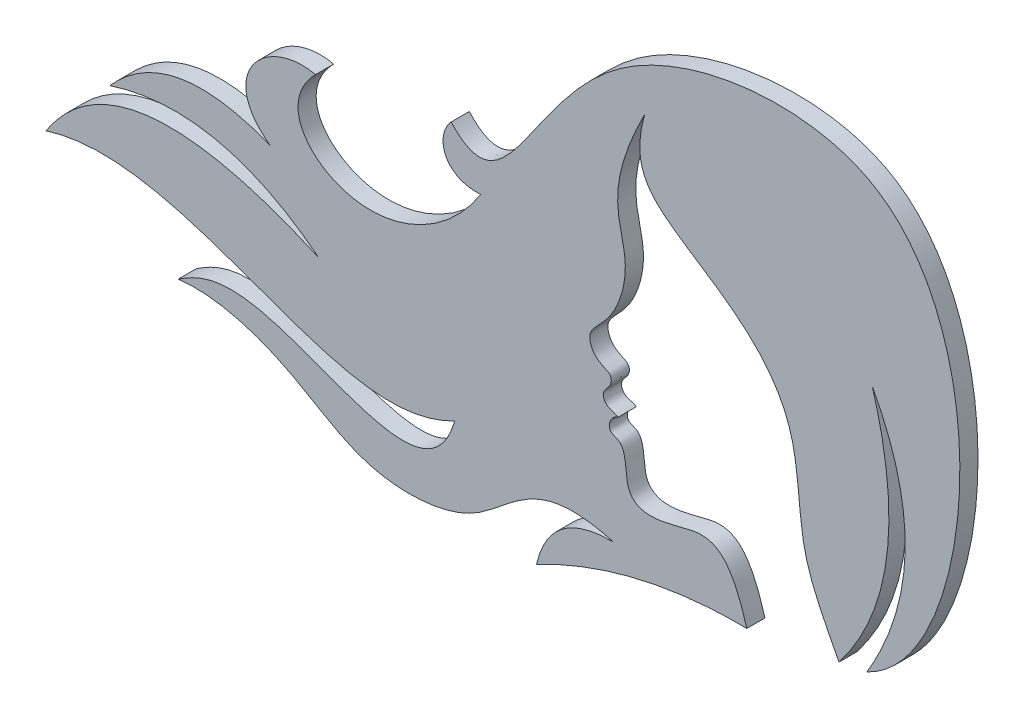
ISO-10303-21;
HEADER;
FILE_DESCRIPTION(('STEP AP214'),'2;1');
FILE_NAME('part.step','',(''),(''),'','','');
FILE_SCHEMA(('AUTOMOTIVE_DESIGN { 1 0 10303 214 1 1 1 1 }'));
ENDSEC;
DATA;
#1=APPLICATION_CONTEXT('core data for automotive mechanical design processes');
#2=APPLICATION_PROTOCOL_DEFINITION('international standard','automotive_design',2000,#1);
#3=PRODUCT_CONTEXT('',#1,'mechanical');
#4=PRODUCT('Part','Part','',(#3));
#5=PRODUCT_RELATED_PRODUCT_CATEGORY('part','',(#4));
#6=PRODUCT_DEFINITION_FORMATION('','',#4);
#7=PRODUCT_DEFINITION_CONTEXT('part definition',#1,'design');
#8=PRODUCT_DEFINITION('design','',#6,#7);
#9=PRODUCT_DEFINITION_SHAPE('','',#8);
#10=(LENGTH_UNIT() NAMED_UNIT(*) SI_UNIT(.MILLI.,.METRE.));
#11=(NAMED_UNIT(*) PLANE_ANGLE_UNIT() SI_UNIT($,.RADIAN.));
#12=(NAMED_UNIT(*) SI_UNIT($,.STERADIAN.) SOLID_ANGLE_UNIT());
#13=UNCERTAINTY_MEASURE_WITH_UNIT(LENGTH_MEASURE(1.E-05),#10,'distance_accuracy_value','');
#14=(GEOMETRIC_REPRESENTATION_CONTEXT(3) GLOBAL_UNCERTAINTY_ASSIGNED_CONTEXT((#13)) GLOBAL_UNIT_ASSIGNED_CONTEXT((#10,
#11,#12)) REPRESENTATION_CONTEXT('',''));
#15=CARTESIAN_POINT('',(0.,0.,0.));
#16=DIRECTION('',(0.,0.,1.));
#17=DIRECTION('',(1.,0.,0.));
#18=AXIS2_PLACEMENT_3D('',#15,#16,#17);
#19=CARTESIAN_POINT('',(99.8352403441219,60.9263576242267,10.));
#20=CARTESIAN_POINT('',(137.590325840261,-8.76878707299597,10.));
#21=CARTESIAN_POINT('',(96.8815916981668,-76.9582666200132,10.));
#22=B_SPLINE_CURVE_WITH_KNOTS('',2,(#19,#20,#21),.UNSPECIFIED.,.F.,.F.,(3,3),(0.,1.),.UNSPECIFIED.);
#23=DIRECTION('',(0.,0.,-1.));
#24=VECTOR('',#23,1.);
#25=SURFACE_OF_LINEAR_EXTRUSION('',#22,#24);
#26=CARTESIAN_POINT('',(99.8352403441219,60.9263576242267,0.));
#27=CARTESIAN_POINT('',(137.590325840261,-8.76878707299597,0.));
#28=CARTESIAN_POINT('',(96.8815916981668,-76.9582666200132,0.));
#29=B_SPLINE_CURVE_WITH_KNOTS('',2,(#26,#27,#28),.UNSPECIFIED.,.F.,.F.,(3,3),(0.,1.),.UNSPECIFIED.);
#30=CARTESIAN_POINT('',(99.8352403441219,60.9263576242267,0.));
#31=VERTEX_POINT('',#30);
#32=CARTESIAN_POINT('',(96.8815916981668,-76.9582666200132,0.));
#33=VERTEX_POINT('',#32);
#34=EDGE_CURVE('E408',#31,#33,#29,.T.);
#35=ORIENTED_EDGE('',*,*,#34,.T.);
#36=DIRECTION('',(0.,0.,-1.));
#37=VECTOR('',#36,1.);
#38=CARTESIAN_POINT('',(96.8815916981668,-76.9582666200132,10.));
#39=LINE('',#38,#37);
#40=CARTESIAN_POINT('',(96.8815916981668,-76.9582666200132,10.));
#41=VERTEX_POINT('',#40);
#42=EDGE_CURVE('E11',#41,#33,#39,.T.);
#43=ORIENTED_EDGE('',*,*,#42,.F.);
#44=CARTESIAN_POINT('',(99.8352403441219,60.9263576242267,10.));
#45=VERTEX_POINT('',#44);
#46=EDGE_CURVE('E335',#45,#41,#22,.T.);
#47=ORIENTED_EDGE('',*,*,#46,.F.);
#48=DIRECTION('',(0.,0.,-1.));
#49=VECTOR('',#48,1.);
#50=CARTESIAN_POINT('',(99.8352403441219,60.9263576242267,10.));
#51=LINE('',#50,#49);
#52=EDGE_CURVE('E179',#45,#31,#51,.T.);
#53=ORIENTED_EDGE('',*,*,#52,.T.);
#54=EDGE_LOOP('',(#35,#43,#47,#53));
#55=FACE_BOUND('',#54,.T.);
#56=ADVANCED_FACE('F32',(#55),#25,.F.);
#57=CARTESIAN_POINT('',(96.8815916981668,-76.9582666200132,10.));
#58=CARTESIAN_POINT('',(151.249906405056,-51.4561359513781,10.));
#59=CARTESIAN_POINT('',(169.949297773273,100.000549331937,10.));
#60=CARTESIAN_POINT('',(76.3462922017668,179.474560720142,10.));
#61=CARTESIAN_POINT('',(-80.7115780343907,161.453070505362,10.));
#62=CARTESIAN_POINT('',(-100.716469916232,37.1369566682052,10.));
#63=CARTESIAN_POINT('',(-132.148595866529,70.8984549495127,10.));
#64=B_SPLINE_CURVE_WITH_KNOTS('',3,(#57,#58,#59,#60,#61,#62,#63),.UNSPECIFIED.,.F.,.F.,(4,1,1,1,
4),(0.,0.421721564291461,0.47224751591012,0.700633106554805,1.),.UNSPECIFIED.);
#65=DIRECTION('',(0.,0.,-1.));
#66=VECTOR('',#65,1.);
#67=SURFACE_OF_LINEAR_EXTRUSION('',#64,#66);
#68=CARTESIAN_POINT('',(96.8815916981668,-76.9582666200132,0.));
#69=CARTESIAN_POINT('',(151.249906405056,-51.4561359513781,0.));
#70=CARTESIAN_POINT('',(169.949297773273,100.000549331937,0.));
#71=CARTESIAN_POINT('',(76.3462922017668,179.474560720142,0.));
#72=CARTESIAN_POINT('',(-80.7115780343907,161.453070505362,0.));
#73=CARTESIAN_POINT('',(-100.716469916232,37.1369566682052,0.));
#74=CARTESIAN_POINT('',(-132.148595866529,70.8984549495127,0.));
#75=B_SPLINE_CURVE_WITH_KNOTS('',3,(#68,#69,#70,#71,#72,#73,#74),.UNSPECIFIED.,.F.,.F.,(4,1,1,1,
4),(0.,0.421721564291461,0.47224751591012,0.700633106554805,1.),.UNSPECIFIED.);
#76=CARTESIAN_POINT('',(-132.148595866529,70.8984549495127,0.));
#77=VERTEX_POINT('',#76);
#78=EDGE_CURVE('E402',#33,#77,#75,.T.);
#79=ORIENTED_EDGE('',*,*,#78,.T.);
#80=DIRECTION('',(0.,0.,-1.));
#81=VECTOR('',#80,1.);
#82=CARTESIAN_POINT('',(-132.148595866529,70.8984549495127,10.));
#83=LINE('',#82,#81);
#84=CARTESIAN_POINT('',(-132.148595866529,70.8984549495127,10.));
#85=VERTEX_POINT('',#84);
#86=EDGE_CURVE('E41',#85,#77,#83,.T.);
#87=ORIENTED_EDGE('',*,*,#86,.F.);
#88=EDGE_CURVE('E119',#41,#85,#64,.T.);
#89=ORIENTED_EDGE('',*,*,#88,.F.);
#90=ORIENTED_EDGE('',*,*,#42,.T.);
#91=EDGE_LOOP('',(#79,#87,#89,#90));
#92=FACE_BOUND('',#91,.T.);
#93=ADVANCED_FACE('F329',(#92),#67,.F.);
#94=CARTESIAN_POINT('',(-132.148595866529,70.8984549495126,10.));
#95=CARTESIAN_POINT('',(-141.700592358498,60.3257250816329,10.));
#96=CARTESIAN_POINT('',(-135.75112447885,42.9581999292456,10.));
#97=CARTESIAN_POINT('',(-115.791263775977,44.5518507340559,10.));
#98=B_SPLINE_CURVE_WITH_KNOTS('',3,(#94,#95,#96,#97),.UNSPECIFIED.,.F.,.F.,(4,4),(0.,1.),.UNSPECIFIED.);
#99=DIRECTION('',(0.,0.,-1.));
#100=VECTOR('',#99,1.);
#101=SURFACE_OF_LINEAR_EXTRUSION('',#98,#100);
#102=CARTESIAN_POINT('',(-132.148595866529,70.8984549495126,0.));
#103=CARTESIAN_POINT('',(-141.700592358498,60.3257250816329,0.));
#104=CARTESIAN_POINT('',(-135.75112447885,42.9581999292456,0.));
#105=CARTESIAN_POINT('',(-115.791263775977,44.5518507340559,0.));
#106=B_SPLINE_CURVE_WITH_KNOTS('',3,(#102,#103,#104,#105),.UNSPECIFIED.,.F.,.F.,(4,4),(0.,1.),.UNSPECIFIED.);
#107=CARTESIAN_POINT('',(-115.791263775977,44.5518507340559,0.));
#108=VERTEX_POINT('',#107);
#109=EDGE_CURVE('E397',#77,#108,#106,.T.);
#110=ORIENTED_EDGE('',*,*,#109,.T.);
#111=DIRECTION('',(0.,0.,-1.));
#112=VECTOR('',#111,1.);
#113=CARTESIAN_POINT('',(-115.791263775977,44.5518507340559,10.));
#114=LINE('',#113,#112);
#115=CARTESIAN_POINT('',(-115.791263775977,44.5518507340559,10.));
#116=VERTEX_POINT('',#115);
#117=EDGE_CURVE('E391',#116,#108,#114,.T.);
#118=ORIENTED_EDGE('',*,*,#117,.F.);
#119=EDGE_CURVE('E315',#85,#116,#98,.T.);
#120=ORIENTED_EDGE('',*,*,#119,.F.);
#121=ORIENTED_EDGE('',*,*,#86,.T.);
#122=EDGE_LOOP('',(#110,#118,#120,#121));
#123=FACE_BOUND('',#122,.T.);
#124=ADVANCED_FACE('F326',(#123),#101,.F.);
#125=CARTESIAN_POINT('',(-115.791263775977,44.5518507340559,10.));
#126=CARTESIAN_POINT('',(-135.439486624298,13.6685695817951,10.));
#127=CARTESIAN_POINT('',(-193.356166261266,-8.74086985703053,10.));
#128=CARTESIAN_POINT('',(-227.746354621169,34.902635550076,10.));
#129=CARTESIAN_POINT('',(-206.820135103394,56.1612771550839,10.));
#130=B_SPLINE_CURVE_WITH_KNOTS('',3,(#125,#126,#127,#128,#129),.UNSPECIFIED.,.F.,.F.,(4,1,4),
(0.,0.521453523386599,1.),.UNSPECIFIED.);
#131=DIRECTION('',(0.,0.,-1.));
#132=VECTOR('',#131,1.);
#133=SURFACE_OF_LINEAR_EXTRUSION('',#130,#132);
#134=CARTESIAN_POINT('',(-115.791263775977,44.5518507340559,0.));
#135=CARTESIAN_POINT('',(-135.439486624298,13.6685695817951,0.));
#136=CARTESIAN_POINT('',(-193.356166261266,-8.74086985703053,0.));
#137=CARTESIAN_POINT('',(-227.746354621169,34.902635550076,0.));
#138=CARTESIAN_POINT('',(-206.820135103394,56.1612771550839,0.));
#139=B_SPLINE_CURVE_WITH_KNOTS('',3,(#134,#135,#136,#137,#138),.UNSPECIFIED.,.F.,.F.,(4,1,4),
(0.,0.521453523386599,1.),.UNSPECIFIED.);
#140=CARTESIAN_POINT('',(-206.820135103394,56.1612771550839,0.));
#141=VERTEX_POINT('',#140);
#142=EDGE_CURVE('E404',#108,#141,#139,.T.);
#143=ORIENTED_EDGE('',*,*,#142,.T.);
#144=DIRECTION('',(0.,0.,-1.));
#145=VECTOR('',#144,1.);
#146=CARTESIAN_POINT('',(-206.820135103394,56.1612771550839,10.));
#147=LINE('',#146,#145);
#148=CARTESIAN_POINT('',(-206.820135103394,56.1612771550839,10.));
#149=VERTEX_POINT('',#148);
#150=EDGE_CURVE('E388',#149,#141,#147,.T.);
#151=ORIENTED_EDGE('',*,*,#150,.F.);
#152=EDGE_CURVE('E307',#116,#149,#130,.T.);
#153=ORIENTED_EDGE('',*,*,#152,.F.);
#154=ORIENTED_EDGE('',*,*,#117,.T.);
#155=EDGE_LOOP('',(#143,#151,#153,#154));
#156=FACE_BOUND('',#155,.T.);
#157=ADVANCED_FACE('F323',(#156),#133,.F.);
#158=CARTESIAN_POINT('',(-206.820135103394,56.1612771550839,10.));
#159=CARTESIAN_POINT('',(-234.246412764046,62.3301629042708,10.));
#160=CARTESIAN_POINT('',(-262.813753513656,32.2946086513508,10.));
#161=CARTESIAN_POINT('',(-231.67156276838,9.8032229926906,10.));
#162=B_SPLINE_CURVE_WITH_KNOTS('',3,(#158,#159,#160,#161),.UNSPECIFIED.,.F.,.F.,(4,4),(0.,1.),.UNSPECIFIED.);
#163=DIRECTION('',(0.,0.,-1.));
#164=VECTOR('',#163,1.);
#165=SURFACE_OF_LINEAR_EXTRUSION('',#162,#164);
#166=CARTESIAN_POINT('',(-206.820135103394,56.1612771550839,0.));
#167=CARTESIAN_POINT('',(-234.246412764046,62.3301629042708,0.));
#168=CARTESIAN_POINT('',(-262.813753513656,32.2946086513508,0.));
#169=CARTESIAN_POINT('',(-231.67156276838,9.8032229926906,0.));
#170=B_SPLINE_CURVE_WITH_KNOTS('',3,(#166,#167,#168,#169),.UNSPECIFIED.,.F.,.F.,(4,4),(0.,1.),.UNSPECIFIED.);
#171=CARTESIAN_POINT('',(-231.67156276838,9.8032229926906,0.));
#172=VERTEX_POINT('',#171);
#173=EDGE_CURVE('E406',#141,#172,#170,.T.);
#174=ORIENTED_EDGE('',*,*,#173,.T.);
#175=DIRECTION('',(0.,0.,-1.));
#176=VECTOR('',#175,1.);
#177=CARTESIAN_POINT('',(-231.67156276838,9.8032229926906,10.));
#178=LINE('',#177,#176);
#179=CARTESIAN_POINT('',(-231.67156276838,9.8032229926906,10.));
#180=VERTEX_POINT('',#179);
#181=EDGE_CURVE('E385',#180,#172,#178,.T.);
#182=ORIENTED_EDGE('',*,*,#181,.F.);
#183=EDGE_CURVE('E299',#149,#180,#162,.T.);
#184=ORIENTED_EDGE('',*,*,#183,.F.);
#185=ORIENTED_EDGE('',*,*,#150,.T.);
#186=EDGE_LOOP('',(#174,#182,#184,#185));
#187=FACE_BOUND('',#186,.T.);
#188=ADVANCED_FACE('F291',(#187),#165,.F.);
#189=CARTESIAN_POINT('',(-231.67156276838,9.80322299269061,10.));
#190=CARTESIAN_POINT('',(-286.85305069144,31.9451961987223,10.));
#191=CARTESIAN_POINT('',(-320.13333992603,-5.71931170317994,10.));
#192=B_SPLINE_CURVE_WITH_KNOTS('',2,(#189,#190,#191),.UNSPECIFIED.,.F.,.F.,(3,3),(0.,1.),.UNSPECIFIED.);
#193=DIRECTION('',(0.,0.,-1.));
#194=VECTOR('',#193,1.);
#195=SURFACE_OF_LINEAR_EXTRUSION('',#192,#194);
#196=CARTESIAN_POINT('',(-231.67156276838,9.80322299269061,0.));
#197=CARTESIAN_POINT('',(-286.85305069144,31.9451961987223,0.));
#198=CARTESIAN_POINT('',(-320.13333992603,-5.71931170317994,0.));
#199=B_SPLINE_CURVE_WITH_KNOTS('',2,(#196,#197,#198),.UNSPECIFIED.,.F.,.F.,(3,3),(0.,1.),.UNSPECIFIED.);
#200=CARTESIAN_POINT('',(-320.13333992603,-5.71931170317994,0.));
#201=VERTEX_POINT('',#200);
#202=EDGE_CURVE('E426',#172,#201,#199,.T.);
#203=ORIENTED_EDGE('',*,*,#202,.T.);
#204=DIRECTION('',(0.,0.,-1.));
#205=VECTOR('',#204,1.);
#206=CARTESIAN_POINT('',(-320.13333992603,-5.71931170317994,10.));
#207=LINE('',#206,#205);
#208=CARTESIAN_POINT('',(-320.13333992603,-5.71931170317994,10.));
#209=VERTEX_POINT('',#208);
#210=EDGE_CURVE('E382',#209,#201,#207,.T.);
#211=ORIENTED_EDGE('',*,*,#210,.F.);
#212=EDGE_CURVE('E295',#180,#209,#192,.T.);
#213=ORIENTED_EDGE('',*,*,#212,.F.);
#214=ORIENTED_EDGE('',*,*,#181,.T.);
#215=EDGE_LOOP('',(#203,#211,#213,#214));
#216=FACE_BOUND('',#215,.T.);
#217=ADVANCED_FACE('F287',(#216),#195,.F.);
#218=CARTESIAN_POINT('',(-320.13333992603,-5.71931170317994,10.));
#219=CARTESIAN_POINT('',(-260.532142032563,13.531515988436,10.));
#220=CARTESIAN_POINT('',(-204.885519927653,-30.3887998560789,10.));
#221=B_SPLINE_CURVE_WITH_KNOTS('',2,(#218,#219,#220),.UNSPECIFIED.,.F.,.F.,(3,3),(0.,1.),.UNSPECIFIED.);
#222=DIRECTION('',(0.,0.,-1.));
#223=VECTOR('',#222,1.);
#224=SURFACE_OF_LINEAR_EXTRUSION('',#221,#223);
#225=CARTESIAN_POINT('',(-320.13333992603,-5.71931170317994,0.));
#226=CARTESIAN_POINT('',(-260.532142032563,13.531515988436,0.));
#227=CARTESIAN_POINT('',(-204.885519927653,-30.3887998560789,0.));
#228=B_SPLINE_CURVE_WITH_KNOTS('',2,(#225,#226,#227),.UNSPECIFIED.,.F.,.F.,(3,3),(0.,1.),.UNSPECIFIED.);
#229=CARTESIAN_POINT('',(-204.885519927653,-30.3887998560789,0.));
#230=VERTEX_POINT('',#229);
#231=EDGE_CURVE('E433',#201,#230,#228,.T.);
#232=ORIENTED_EDGE('',*,*,#231,.T.);
#233=DIRECTION('',(0.,0.,-1.));
#234=VECTOR('',#233,1.);
#235=CARTESIAN_POINT('',(-204.885519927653,-30.3887998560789,10.));
#236=LINE('',#235,#234);
#237=CARTESIAN_POINT('',(-204.885519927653,-30.3887998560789,10.));
#238=VERTEX_POINT('',#237);
#239=EDGE_CURVE('E379',#238,#230,#236,.T.);
#240=ORIENTED_EDGE('',*,*,#239,.F.);
#241=EDGE_CURVE('E272',#209,#238,#221,.T.);
#242=ORIENTED_EDGE('',*,*,#241,.F.);
#243=ORIENTED_EDGE('',*,*,#210,.T.);
#244=EDGE_LOOP('',(#232,#240,#242,#243));
#245=FACE_BOUND('',#244,.T.);
#246=ADVANCED_FACE('F283',(#245),#224,.F.);
#247=CARTESIAN_POINT('',(-204.885519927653,-30.3887998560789,10.));
#248=CARTESIAN_POINT('',(-314.211220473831,18.7262655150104,10.));
#249=CARTESIAN_POINT('',(-355.30953903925,-44.8919209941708,10.));
#250=B_SPLINE_CURVE_WITH_KNOTS('',2,(#247,#248,#249),.UNSPECIFIED.,.F.,.F.,(3,3),(0.,1.),.UNSPECIFIED.);
#251=DIRECTION('',(0.,0.,-1.));
#252=VECTOR('',#251,1.);
#253=SURFACE_OF_LINEAR_EXTRUSION('',#250,#252);
#254=CARTESIAN_POINT('',(-204.885519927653,-30.3887998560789,0.));
#255=CARTESIAN_POINT('',(-314.211220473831,18.7262655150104,0.));
#256=CARTESIAN_POINT('',(-355.30953903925,-44.8919209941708,0.));
#257=B_SPLINE_CURVE_WITH_KNOTS('',2,(#254,#255,#256),.UNSPECIFIED.,.F.,.F.,(3,3),(0.,1.),.UNSPECIFIED.);
#258=CARTESIAN_POINT('',(-355.30953903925,-44.8919209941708,0.));
#259=VERTEX_POINT('',#258);
#260=EDGE_CURVE('E440',#230,#259,#257,.T.);
#261=ORIENTED_EDGE('',*,*,#260,.T.);
#262=DIRECTION('',(0.,0.,-1.));
#263=VECTOR('',#262,1.);
#264=CARTESIAN_POINT('',(-355.30953903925,-44.8919209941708,10.));
#265=LINE('',#264,#263);
#266=CARTESIAN_POINT('',(-355.30953903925,-44.8919209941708,10.));
#267=VERTEX_POINT('',#266);
#268=EDGE_CURVE('E376',#267,#259,#265,.T.);
#269=ORIENTED_EDGE('',*,*,#268,.F.);
#270=EDGE_CURVE('E264',#238,#267,#250,.T.);
#271=ORIENTED_EDGE('',*,*,#270,.F.);
#272=ORIENTED_EDGE('',*,*,#239,.T.);
#273=EDGE_LOOP('',(#261,#269,#271,#272));
#274=FACE_BOUND('',#273,.T.);
#275=ADVANCED_FACE('F280',(#274),#253,.F.);
#276=CARTESIAN_POINT('',(-355.30953903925,-44.8919209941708,10.));
#277=CARTESIAN_POINT('',(-281.11164015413,-21.0648694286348,10.));
#278=CARTESIAN_POINT('',(-207.554873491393,-89.7677891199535,10.));
#279=CARTESIAN_POINT('',(-162.853756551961,-87.2780492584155,10.));
#280=CARTESIAN_POINT('',(-130.126908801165,-70.7790967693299,10.));
#281=B_SPLINE_CURVE_WITH_KNOTS('',4,(#276,#277,#278,#279,#280),.UNSPECIFIED.,.F.,.F.,(5,5),(0.,
1.),.UNSPECIFIED.);
#282=DIRECTION('',(0.,0.,-1.));
#283=VECTOR('',#282,1.);
#284=SURFACE_OF_LINEAR_EXTRUSION('',#281,#283);
#285=CARTESIAN_POINT('',(-355.30953903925,-44.8919209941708,0.));
#286=CARTESIAN_POINT('',(-281.11164015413,-21.0648694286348,0.));
#287=CARTESIAN_POINT('',(-207.554873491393,-89.7677891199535,0.));
#288=CARTESIAN_POINT('',(-162.853756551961,-87.2780492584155,0.));
#289=CARTESIAN_POINT('',(-130.126908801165,-70.7790967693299,0.));
#290=B_SPLINE_CURVE_WITH_KNOTS('',4,(#285,#286,#287,#288,#289),.UNSPECIFIED.,.F.,.F.,(5,5),(0.,
1.),.UNSPECIFIED.);
#291=CARTESIAN_POINT('',(-130.126908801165,-70.7790967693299,0.));
#292=VERTEX_POINT('',#291);
#293=EDGE_CURVE('E447',#259,#292,#290,.T.);
#294=ORIENTED_EDGE('',*,*,#293,.T.);
#295=DIRECTION('',(0.,0.,-1.));
#296=VECTOR('',#295,1.);
#297=CARTESIAN_POINT('',(-130.126908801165,-70.7790967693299,10.));
#298=LINE('',#297,#296);
#299=CARTESIAN_POINT('',(-130.126908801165,-70.7790967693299,10.));
#300=VERTEX_POINT('',#299);
#301=EDGE_CURVE('E373',#300,#292,#298,.T.);
#302=ORIENTED_EDGE('',*,*,#301,.F.);
#303=EDGE_CURVE('E256',#267,#300,#281,.T.);
#304=ORIENTED_EDGE('',*,*,#303,.F.);
#305=ORIENTED_EDGE('',*,*,#268,.T.);
#306=EDGE_LOOP('',(#294,#302,#304,#305));
#307=FACE_BOUND('',#306,.T.);
#308=ADVANCED_FACE('F248',(#307),#284,.F.);
#309=CARTESIAN_POINT('',(-130.126908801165,-70.7790967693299,10.));
#310=CARTESIAN_POINT('',(-149.062899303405,-135.871564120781,10.));
#311=CARTESIAN_POINT('',(-228.830759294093,-51.3697065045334,10.));
#312=CARTESIAN_POINT('',(-259.719272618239,-64.2389946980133,10.));
#313=CARTESIAN_POINT('',(-282.507718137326,-79.2554248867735,10.));
#314=B_SPLINE_CURVE_WITH_KNOTS('',4,(#309,#310,#311,#312,#313),.UNSPECIFIED.,.F.,.F.,(5,5),(0.,
1.),.UNSPECIFIED.);
#315=DIRECTION('',(0.,0.,-1.));
#316=VECTOR('',#315,1.);
#317=SURFACE_OF_LINEAR_EXTRUSION('',#314,#316);
#318=CARTESIAN_POINT('',(-130.126908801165,-70.7790967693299,0.));
#319=CARTESIAN_POINT('',(-149.062899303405,-135.871564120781,0.));
#320=CARTESIAN_POINT('',(-228.830759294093,-51.3697065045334,0.));
#321=CARTESIAN_POINT('',(-259.719272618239,-64.2389946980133,0.));
#322=CARTESIAN_POINT('',(-282.507718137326,-79.2554248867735,0.));
#323=B_SPLINE_CURVE_WITH_KNOTS('',4,(#318,#319,#320,#321,#322),.UNSPECIFIED.,.F.,.F.,(5,5),(0.,
1.),.UNSPECIFIED.);
#324=CARTESIAN_POINT('',(-282.507718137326,-79.2554248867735,0.));
#325=VERTEX_POINT('',#324);
#326=EDGE_CURVE('E454',#292,#325,#323,.T.);
#327=ORIENTED_EDGE('',*,*,#326,.T.);
#328=DIRECTION('',(0.,0.,-1.));
#329=VECTOR('',#328,1.);
#330=CARTESIAN_POINT('',(-282.507718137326,-79.2554248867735,10.));
#331=LINE('',#330,#329);
#332=CARTESIAN_POINT('',(-282.507718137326,-79.2554248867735,10.));
#333=VERTEX_POINT('',#332);
#334=EDGE_CURVE('E370',#333,#325,#331,.T.);
#335=ORIENTED_EDGE('',*,*,#334,.F.);
#336=EDGE_CURVE('E252',#300,#333,#314,.T.);
#337=ORIENTED_EDGE('',*,*,#336,.F.);
#338=ORIENTED_EDGE('',*,*,#301,.T.);
#339=EDGE_LOOP('',(#327,#335,#337,#338));
#340=FACE_BOUND('',#339,.T.);
#341=ADVANCED_FACE('F244',(#340),#317,.F.);
#342=CARTESIAN_POINT('',(-282.507718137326,-79.2554248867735,10.));
#343=CARTESIAN_POINT('',(-269.859036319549,-77.56804431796,10.));
#344=CARTESIAN_POINT('',(-220.246837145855,-85.7671579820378,10.));
#345=CARTESIAN_POINT('',(-188.940245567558,-121.497280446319,10.));
#346=CARTESIAN_POINT('',(-104.940933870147,-116.747440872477,10.));
#347=CARTESIAN_POINT('',(-89.0037621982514,-71.6678324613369,10.));
#348=CARTESIAN_POINT('',(-42.6454999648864,-84.7637430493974,10.));
#349=B_SPLINE_CURVE_WITH_KNOTS('',3,(#342,#343,#344,#345,#346,#347,#348),.UNSPECIFIED.,.F.,.F.,
(4,1,1,1,4),(0.,0.11272234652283,0.428829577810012,0.649909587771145,1.),.UNSPECIFIED.);
#350=DIRECTION('',(0.,0.,-1.));
#351=VECTOR('',#350,1.);
#352=SURFACE_OF_LINEAR_EXTRUSION('',#349,#351);
#353=CARTESIAN_POINT('',(-282.507718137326,-79.2554248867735,0.));
#354=CARTESIAN_POINT('',(-269.859036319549,-77.56804431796,0.));
#355=CARTESIAN_POINT('',(-220.246837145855,-85.7671579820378,0.));
#356=CARTESIAN_POINT('',(-188.940245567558,-121.497280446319,0.));
#357=CARTESIAN_POINT('',(-104.940933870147,-116.747440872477,0.));
#358=CARTESIAN_POINT('',(-89.0037621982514,-71.6678324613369,0.));
#359=CARTESIAN_POINT('',(-42.6454999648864,-84.7637430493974,0.));
#360=B_SPLINE_CURVE_WITH_KNOTS('',3,(#353,#354,#355,#356,#357,#358,#359),.UNSPECIFIED.,.F.,.F.,
(4,1,1,1,4),(0.,0.11272234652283,0.428829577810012,0.649909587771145,1.),.UNSPECIFIED.);
#361=CARTESIAN_POINT('',(-42.6454999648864,-84.7637430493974,0.));
#362=VERTEX_POINT('',#361);
#363=EDGE_CURVE('E461',#325,#362,#360,.T.);
#364=ORIENTED_EDGE('',*,*,#363,.T.);
#365=DIRECTION('',(0.,0.,-1.));
#366=VECTOR('',#365,1.);
#367=CARTESIAN_POINT('',(-42.6454999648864,-84.7637430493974,10.));
#368=LINE('',#367,#366);
#369=CARTESIAN_POINT('',(-42.6454999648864,-84.7637430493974,10.));
#370=VERTEX_POINT('',#369);
#371=EDGE_CURVE('E367',#370,#362,#368,.T.);
#372=ORIENTED_EDGE('',*,*,#371,.F.);
#373=EDGE_CURVE('E229',#333,#370,#349,.T.);
#374=ORIENTED_EDGE('',*,*,#373,.F.);
#375=ORIENTED_EDGE('',*,*,#334,.T.);
#376=EDGE_LOOP('',(#364,#372,#374,#375));
#377=FACE_BOUND('',#376,.T.);
#378=ADVANCED_FACE('F240',(#377),#352,.F.);
#379=CARTESIAN_POINT('',(-42.6454999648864,-84.7637430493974,10.));
#380=CARTESIAN_POINT('',(-77.6160107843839,-84.5108672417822,10.));
#381=CARTESIAN_POINT('',(-85.073832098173,-116.568907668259,10.));
#382=B_SPLINE_CURVE_WITH_KNOTS('',2,(#379,#380,#381),.UNSPECIFIED.,.F.,.F.,(3,3),(0.,1.),.UNSPECIFIED.);
#383=DIRECTION('',(0.,0.,-1.));
#384=VECTOR('',#383,1.);
#385=SURFACE_OF_LINEAR_EXTRUSION('',#382,#384);
#386=CARTESIAN_POINT('',(-42.6454999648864,-84.7637430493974,0.));
#387=CARTESIAN_POINT('',(-77.6160107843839,-84.5108672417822,0.));
#388=CARTESIAN_POINT('',(-85.073832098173,-116.568907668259,0.));
#389=B_SPLINE_CURVE_WITH_KNOTS('',2,(#386,#387,#388),.UNSPECIFIED.,.F.,.F.,(3,3),(0.,1.),.UNSPECIFIED.);
#390=CARTESIAN_POINT('',(-85.073832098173,-116.568907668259,0.));
#391=VERTEX_POINT('',#390);
#392=EDGE_CURVE('E468',#362,#391,#389,.T.);
#393=ORIENTED_EDGE('',*,*,#392,.T.);
#394=DIRECTION('',(0.,0.,-1.));
#395=VECTOR('',#394,1.);
#396=CARTESIAN_POINT('',(-85.073832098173,-116.568907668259,10.));
#397=LINE('',#396,#395);
#398=CARTESIAN_POINT('',(-85.073832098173,-116.568907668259,10.));
#399=VERTEX_POINT('',#398);
#400=EDGE_CURVE('E364',#399,#391,#397,.T.);
#401=ORIENTED_EDGE('',*,*,#400,.F.);
#402=EDGE_CURVE('E221',#370,#399,#382,.T.);
#403=ORIENTED_EDGE('',*,*,#402,.F.);
#404=ORIENTED_EDGE('',*,*,#371,.T.);
#405=EDGE_LOOP('',(#393,#401,#403,#404));
#406=FACE_BOUND('',#405,.T.);
#407=ADVANCED_FACE('F237',(#406),#385,.F.);
#408=CARTESIAN_POINT('',(-85.073832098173,-116.568907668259,10.));
#409=CARTESIAN_POINT('',(-31.0566543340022,-88.3468480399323,10.));
#410=CARTESIAN_POINT('',(30.7603724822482,-89.2685976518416,10.));
#411=B_SPLINE_CURVE_WITH_KNOTS('',2,(#408,#409,#410),.UNSPECIFIED.,.F.,.F.,(3,3),(0.,1.),.UNSPECIFIED.);
#412=DIRECTION('',(0.,0.,-1.));
#413=VECTOR('',#412,1.);
#414=SURFACE_OF_LINEAR_EXTRUSION('',#411,#413);
#415=CARTESIAN_POINT('',(-85.073832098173,-116.568907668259,0.));
#416=CARTESIAN_POINT('',(-31.0566543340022,-88.3468480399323,0.));
#417=CARTESIAN_POINT('',(30.7603724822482,-89.2685976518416,0.));
#418=B_SPLINE_CURVE_WITH_KNOTS('',2,(#415,#416,#417),.UNSPECIFIED.,.F.,.F.,(3,3),(0.,1.),.UNSPECIFIED.);
#419=CARTESIAN_POINT('',(30.7603724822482,-89.2685976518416,0.));
#420=VERTEX_POINT('',#419);
#421=EDGE_CURVE('E475',#391,#420,#418,.T.);
#422=ORIENTED_EDGE('',*,*,#421,.T.);
#423=DIRECTION('',(0.,0.,-1.));
#424=VECTOR('',#423,1.);
#425=CARTESIAN_POINT('',(30.7603724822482,-89.2685976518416,10.));
#426=LINE('',#425,#424);
#427=CARTESIAN_POINT('',(30.7603724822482,-89.2685976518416,10.));
#428=VERTEX_POINT('',#427);
#429=EDGE_CURVE('E361',#428,#420,#426,.T.);
#430=ORIENTED_EDGE('',*,*,#429,.F.);
#431=EDGE_CURVE('E213',#399,#428,#411,.T.);
#432=ORIENTED_EDGE('',*,*,#431,.F.);
#433=ORIENTED_EDGE('',*,*,#400,.T.);
#434=EDGE_LOOP('',(#422,#430,#432,#433));
#435=FACE_BOUND('',#434,.T.);
#436=ADVANCED_FACE('F206',(#435),#414,.F.);
#437=CARTESIAN_POINT('',(30.7603724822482,-89.2685976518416,10.));
#438=CARTESIAN_POINT('',(19.4296879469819,-49.6692660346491,10.));
#439=CARTESIAN_POINT('',(-1.98620908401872,-60.3796240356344,10.));
#440=CARTESIAN_POINT('',(-38.406899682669,-65.1344416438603,10.));
#441=CARTESIAN_POINT('',(-34.8514093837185,-34.6017335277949,10.));
#442=CARTESIAN_POINT('',(-46.9784903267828,-33.3839305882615,10.));
#443=CARTESIAN_POINT('',(-44.0761329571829,-25.0411766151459,10.));
#444=CARTESIAN_POINT('',(-40.0406940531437,-23.8378800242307,10.));
#445=B_SPLINE_CURVE_WITH_KNOTS('',3,(#437,#438,#439,#440,#441,#442,#443,#444),.UNSPECIFIED.,.F.,
.F.,(4,1,1,1,1,4),(0.,0.437887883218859,0.723491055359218,0.877076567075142,0.931754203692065,
1.),.UNSPECIFIED.);
#446=DIRECTION('',(0.,0.,-1.));
#447=VECTOR('',#446,1.);
#448=SURFACE_OF_LINEAR_EXTRUSION('',#445,#447);
#449=CARTESIAN_POINT('',(30.7603724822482,-89.2685976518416,0.));
#450=CARTESIAN_POINT('',(19.4296879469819,-49.6692660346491,0.));
#451=CARTESIAN_POINT('',(-1.98620908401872,-60.3796240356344,0.));
#452=CARTESIAN_POINT('',(-38.406899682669,-65.1344416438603,0.));
#453=CARTESIAN_POINT('',(-34.8514093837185,-34.6017335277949,0.));
#454=CARTESIAN_POINT('',(-46.9784903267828,-33.3839305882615,0.));
#455=CARTESIAN_POINT('',(-44.0761329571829,-25.0411766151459,0.));
#456=CARTESIAN_POINT('',(-40.0406940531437,-23.8378800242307,0.));
#457=B_SPLINE_CURVE_WITH_KNOTS('',3,(#449,#450,#451,#452,#453,#454,#455,#456),.UNSPECIFIED.,.F.,
.F.,(4,1,1,1,1,4),(0.,0.437887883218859,0.723491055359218,0.877076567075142,0.931754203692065,
1.),.UNSPECIFIED.);
#458=CARTESIAN_POINT('',(-40.0406940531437,-23.8378800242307,0.));
#459=VERTEX_POINT('',#458);
#460=EDGE_CURVE('E482',#420,#459,#457,.T.);
#461=ORIENTED_EDGE('',*,*,#460,.T.);
#462=DIRECTION('',(0.,0.,-1.));
#463=VECTOR('',#462,1.);
#464=CARTESIAN_POINT('',(-40.0406940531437,-23.8378800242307,10.));
#465=LINE('',#464,#463);
#466=CARTESIAN_POINT('',(-40.0406940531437,-23.8378800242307,10.));
#467=VERTEX_POINT('',#466);
#468=EDGE_CURVE('E174',#467,#459,#465,.T.);
#469=ORIENTED_EDGE('',*,*,#468,.F.);
#470=EDGE_CURVE('E165',#428,#467,#445,.T.);
#471=ORIENTED_EDGE('',*,*,#470,.F.);
#472=ORIENTED_EDGE('',*,*,#429,.T.);
#473=EDGE_LOOP('',(#461,#469,#471,#472));
#474=FACE_BOUND('',#473,.T.);
#475=ADVANCED_FACE('F203',(#474),#448,.F.);
#476=CARTESIAN_POINT('',(-40.0406940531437,-23.8378800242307,10.));
#477=CARTESIAN_POINT('',(-43.2590413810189,-22.1214281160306,10.));
#478=CARTESIAN_POINT('',(-46.8278362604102,-22.811252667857,10.));
#479=CARTESIAN_POINT('',(-49.3116802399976,-14.8486498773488,10.));
#480=CARTESIAN_POINT('',(-43.6915711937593,-11.9856337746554,10.));
#481=CARTESIAN_POINT('',(-44.0455555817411,-3.25428780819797,10.));
#482=CARTESIAN_POINT('',(-53.6486034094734,-4.29864146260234,10.));
#483=CARTESIAN_POINT('',(-56.755652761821,9.62980988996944,10.));
#484=CARTESIAN_POINT('',(-41.0609747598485,22.3908455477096,10.));
#485=CARTESIAN_POINT('',(-29.0510095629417,64.9817504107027,10.));
#486=CARTESIAN_POINT('',(-50.6895673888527,78.3832678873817,10.));
#487=CARTESIAN_POINT('',(-25.5912188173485,127.690024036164,10.));
#488=B_SPLINE_CURVE_WITH_KNOTS('',3,(#476,#477,#478,#479,#480,#481,#482,#483,#484,#485,#486,
#487),.UNSPECIFIED.,.F.,.F.,(4,1,1,1,1,1,1,1,1,4),(0.,0.0641286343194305,0.0774247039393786,
0.126790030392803,0.140588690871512,0.201612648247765,0.212110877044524,0.237942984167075,
0.306012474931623,0.44052070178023),.UNSPECIFIED.);
#489=DIRECTION('',(0.,0.,-1.));
#490=VECTOR('',#489,1.);
#491=SURFACE_OF_LINEAR_EXTRUSION('',#488,#490);
#492=CARTESIAN_POINT('',(-40.0406940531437,-23.8378800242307,0.));
#493=CARTESIAN_POINT('',(-43.2590413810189,-22.1214281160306,0.));
#494=CARTESIAN_POINT('',(-46.8278362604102,-22.811252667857,0.));
#495=CARTESIAN_POINT('',(-49.3116802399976,-14.8486498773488,0.));
#496=CARTESIAN_POINT('',(-43.6915711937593,-11.9856337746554,0.));
#497=CARTESIAN_POINT('',(-44.0455555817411,-3.25428780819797,0.));
#498=CARTESIAN_POINT('',(-53.6486034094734,-4.29864146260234,0.));
#499=CARTESIAN_POINT('',(-56.755652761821,9.62980988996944,0.));
#500=CARTESIAN_POINT('',(-41.0609747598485,22.3908455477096,0.));
#501=CARTESIAN_POINT('',(-29.0510095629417,64.9817504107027,0.));
#502=CARTESIAN_POINT('',(-50.6895673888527,78.3832678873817,0.));
#503=CARTESIAN_POINT('',(-25.5912188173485,127.690024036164,0.));
#504=B_SPLINE_CURVE_WITH_KNOTS('',3,(#492,#493,#494,#495,#496,#497,#498,#499,#500,#501,#502,
#503),.UNSPECIFIED.,.F.,.F.,(4,1,1,1,1,1,1,1,1,4),(0.,0.0641286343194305,0.0774247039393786,
0.126790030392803,0.140588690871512,0.201612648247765,0.212110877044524,0.237942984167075,
0.306012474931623,0.44052070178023),.UNSPECIFIED.);
#505=CARTESIAN_POINT('',(-25.5912188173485,127.690024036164,0.));
#506=VERTEX_POINT('',#505);
#507=EDGE_CURVE('E173',#459,#506,#504,.T.);
#508=ORIENTED_EDGE('',*,*,#507,.T.);
#509=DIRECTION('',(0.,0.,-1.));
#510=VECTOR('',#509,1.);
#511=CARTESIAN_POINT('',(-25.5912188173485,127.690024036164,10.));
#512=LINE('',#511,#510);
#513=CARTESIAN_POINT('',(-25.5912188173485,127.690024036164,10.));
#514=VERTEX_POINT('',#513);
#515=EDGE_CURVE('E170',#514,#506,#512,.T.);
#516=ORIENTED_EDGE('',*,*,#515,.F.);
#517=EDGE_CURVE('E159',#467,#514,#488,.T.);
#518=ORIENTED_EDGE('',*,*,#517,.F.);
#519=ORIENTED_EDGE('',*,*,#468,.T.);
#520=EDGE_LOOP('',(#508,#516,#518,#519));
#521=FACE_BOUND('',#520,.T.);
#522=ADVANCED_FACE('F171',(#521),#491,.F.);
#523=CARTESIAN_POINT('',(-25.5912188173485,127.690024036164,10.));
#524=CARTESIAN_POINT('',(-32.6041413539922,102.806926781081,10.));
#525=CARTESIAN_POINT('',(-11.0595681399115,75.3073255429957,10.));
#526=CARTESIAN_POINT('',(58.7174490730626,45.5658613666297,10.));
#527=CARTESIAN_POINT('',(59.5158618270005,-37.7394666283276,10.));
#528=CARTESIAN_POINT('',(70.1066357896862,-58.019693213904,10.));
#529=CARTESIAN_POINT('',(81.5187756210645,-79.9359782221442,10.));
#530=B_SPLINE_CURVE_WITH_KNOTS('',3,(#523,#524,#525,#526,#527,#528,#529),.UNSPECIFIED.,.F.,.F.,
(4,1,1,1,4),(0.,0.238784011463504,0.647390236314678,0.80274185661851,1.),.UNSPECIFIED.);
#531=DIRECTION('',(0.,0.,-1.));
#532=VECTOR('',#531,1.);
#533=SURFACE_OF_LINEAR_EXTRUSION('',#530,#532);
#534=CARTESIAN_POINT('',(-25.5912188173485,127.690024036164,0.));
#535=CARTESIAN_POINT('',(-32.6041413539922,102.806926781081,0.));
#536=CARTESIAN_POINT('',(-11.0595681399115,75.3073255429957,0.));
#537=CARTESIAN_POINT('',(58.7174490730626,45.5658613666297,0.));
#538=CARTESIAN_POINT('',(59.5158618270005,-37.7394666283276,0.));
#539=CARTESIAN_POINT('',(70.1066357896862,-58.019693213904,0.));
#540=CARTESIAN_POINT('',(81.5187756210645,-79.9359782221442,0.));
#541=B_SPLINE_CURVE_WITH_KNOTS('',3,(#534,#535,#536,#537,#538,#539,#540),.UNSPECIFIED.,.F.,.F.,
(4,1,1,1,4),(0.,0.238784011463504,0.647390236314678,0.80274185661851,1.),.UNSPECIFIED.);
#542=CARTESIAN_POINT('',(81.5187756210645,-79.9359782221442,0.));
#543=VERTEX_POINT('',#542);
#544=EDGE_CURVE('E105',#506,#543,#541,.T.);
#545=ORIENTED_EDGE('',*,*,#544,.T.);
#546=DIRECTION('',(0.,0.,-1.));
#547=VECTOR('',#546,1.);
#548=CARTESIAN_POINT('',(81.5187756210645,-79.9359782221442,10.));
#549=LINE('',#548,#547);
#550=CARTESIAN_POINT('',(81.5187756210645,-79.9359782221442,10.));
#551=VERTEX_POINT('',#550);
#552=EDGE_CURVE('E175',#551,#543,#549,.T.);
#553=ORIENTED_EDGE('',*,*,#552,.F.);
#554=EDGE_CURVE('E163',#514,#551,#530,.T.);
#555=ORIENTED_EDGE('',*,*,#554,.F.);
#556=ORIENTED_EDGE('',*,*,#515,.T.);
#557=EDGE_LOOP('',(#545,#553,#555,#556));
#558=FACE_BOUND('',#557,.T.);
#559=ADVANCED_FACE('F177',(#558),#533,.F.);
#560=CARTESIAN_POINT('',(81.5187756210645,-79.9359782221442,10.));
#561=CARTESIAN_POINT('',(124.970665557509,-23.842270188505,10.));
#562=CARTESIAN_POINT('',(99.8352403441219,60.9263576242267,10.));
#563=B_SPLINE_CURVE_WITH_KNOTS('',2,(#560,#561,#562),.UNSPECIFIED.,.F.,.F.,(3,3),(0.,1.),.UNSPECIFIED.);
#564=DIRECTION('',(0.,0.,-1.));
#565=VECTOR('',#564,1.);
#566=SURFACE_OF_LINEAR_EXTRUSION('',#563,#565);
#567=CARTESIAN_POINT('',(81.5187756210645,-79.9359782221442,0.));
#568=CARTESIAN_POINT('',(124.970665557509,-23.842270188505,0.));
#569=CARTESIAN_POINT('',(99.8352403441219,60.9263576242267,0.));
#570=B_SPLINE_CURVE_WITH_KNOTS('',2,(#567,#568,#569),.UNSPECIFIED.,.F.,.F.,(3,3),(0.,1.),.UNSPECIFIED.);
#571=EDGE_CURVE('E111',#543,#31,#570,.T.);
#572=ORIENTED_EDGE('',*,*,#571,.T.);
#573=ORIENTED_EDGE('',*,*,#52,.F.);
#574=EDGE_CURVE('E49',#551,#45,#563,.T.);
#575=ORIENTED_EDGE('',*,*,#574,.F.);
#576=ORIENTED_EDGE('',*,*,#552,.T.);
#577=EDGE_LOOP('',(#572,#573,#575,#576));
#578=FACE_BOUND('',#577,.T.);
#579=ADVANCED_FACE('F199',(#578),#566,.F.);
#580=CARTESIAN_POINT('',(117.974370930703,-8.39237078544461,10.));
#581=DIRECTION('',(0.,0.,-1.));
#582=DIRECTION('',(-1.,0.,0.));
#583=AXIS2_PLACEMENT_3D('',#580,#581,#582);
#584=PLANE('',#583);
#585=ORIENTED_EDGE('',*,*,#46,.T.);
#586=ORIENTED_EDGE('',*,*,#88,.T.);
#587=ORIENTED_EDGE('',*,*,#119,.T.);
#588=ORIENTED_EDGE('',*,*,#152,.T.);
#589=ORIENTED_EDGE('',*,*,#183,.T.);
#590=ORIENTED_EDGE('',*,*,#212,.T.);
#591=ORIENTED_EDGE('',*,*,#241,.T.);
#592=ORIENTED_EDGE('',*,*,#270,.T.);
#593=ORIENTED_EDGE('',*,*,#303,.T.);
#594=ORIENTED_EDGE('',*,*,#336,.T.);
#595=ORIENTED_EDGE('',*,*,#373,.T.);
#596=ORIENTED_EDGE('',*,*,#402,.T.);
#597=ORIENTED_EDGE('',*,*,#431,.T.);
#598=ORIENTED_EDGE('',*,*,#470,.T.);
#599=ORIENTED_EDGE('',*,*,#517,.T.);
#600=ORIENTED_EDGE('',*,*,#554,.T.);
#601=ORIENTED_EDGE('',*,*,#574,.T.);
#602=EDGE_LOOP('',(#585,#586,#587,#588,#589,#590,#591,#592,#593,#594,#595,#596,#597,#598,#599,
#600,#601));
#603=FACE_BOUND('',#602,.T.);
#604=ADVANCED_FACE('F161',(#603),#584,.F.);
#605=CARTESIAN_POINT('',(117.974370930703,-8.39237078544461,0.));
#606=DIRECTION('',(0.,0.,-1.));
#607=DIRECTION('',(-1.,0.,0.));
#608=AXIS2_PLACEMENT_3D('',#605,#606,#607);
#609=PLANE('',#608);
#610=ORIENTED_EDGE('',*,*,#34,.F.);
#611=ORIENTED_EDGE('',*,*,#571,.F.);
#612=ORIENTED_EDGE('',*,*,#544,.F.);
#613=ORIENTED_EDGE('',*,*,#507,.F.);
#614=ORIENTED_EDGE('',*,*,#460,.F.);
#615=ORIENTED_EDGE('',*,*,#421,.F.);
#616=ORIENTED_EDGE('',*,*,#392,.F.);
#617=ORIENTED_EDGE('',*,*,#363,.F.);
#618=ORIENTED_EDGE('',*,*,#326,.F.);
#619=ORIENTED_EDGE('',*,*,#293,.F.);
#620=ORIENTED_EDGE('',*,*,#260,.F.);
#621=ORIENTED_EDGE('',*,*,#231,.F.);
#622=ORIENTED_EDGE('',*,*,#202,.F.);
#623=ORIENTED_EDGE('',*,*,#173,.F.);
#624=ORIENTED_EDGE('',*,*,#142,.F.);
#625=ORIENTED_EDGE('',*,*,#109,.F.);
#626=ORIENTED_EDGE('',*,*,#78,.F.);
#627=EDGE_LOOP('',(#610,#611,#612,#613,#614,#615,#616,#617,#618,#619,#620,#621,#622,#623,#624,
#625,#626));
#628=FACE_BOUND('',#627,.T.);
#629=ADVANCED_FACE('F401',(#628),#609,.T.);
#630=CLOSED_SHELL('',(#56,#93,#124,#157,#188,#217,#246,#275,#308,#341,#378,#407,#436,#475,#522,
#559,#579,#604,#629));
#631=MANIFOLD_SOLID_BREP('B2',#630);
#632=ADVANCED_BREP_SHAPE_REPRESENTATION('',(#18,#631),#14);
#633=SHAPE_DEFINITION_REPRESENTATION(#9,#632);
ENDSEC;
END-ISO-10303-21;
